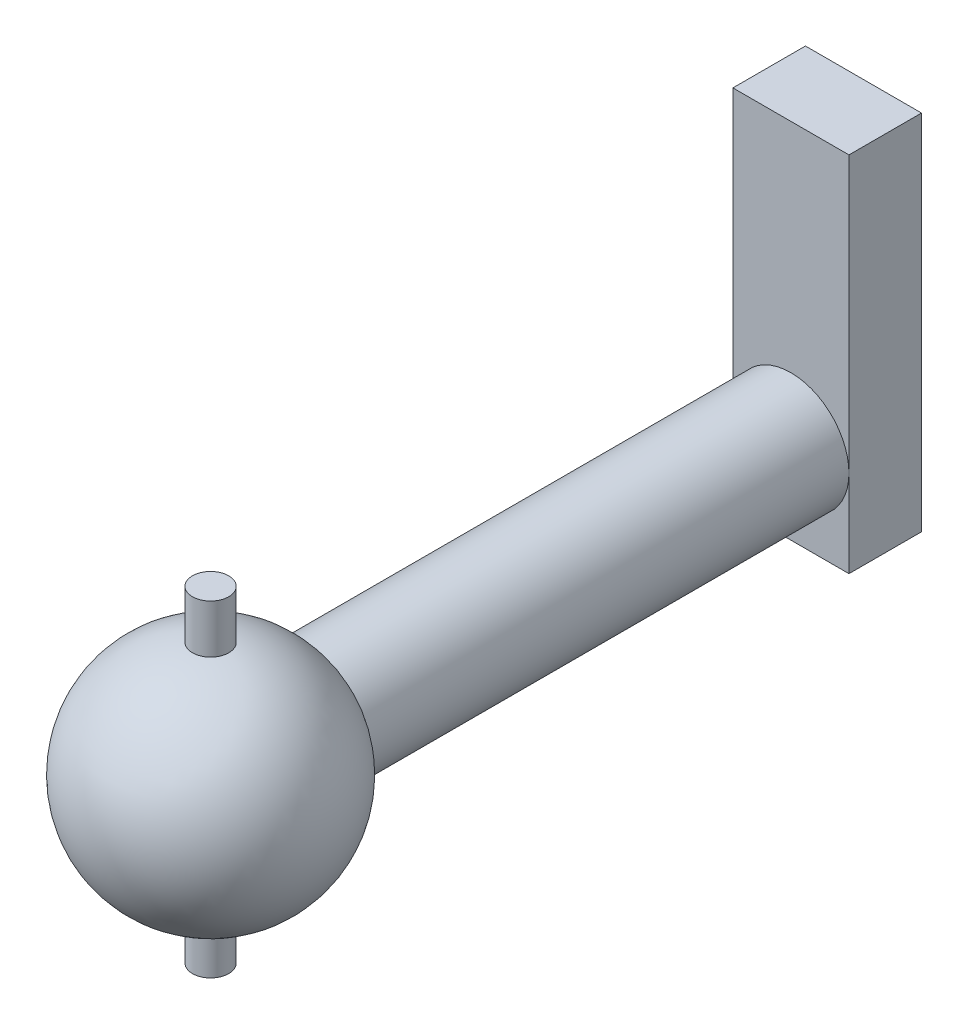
from build123d import *

# Parameters (mm, degrees)
ESQUISSE1_R        = 8
BOSS_EXTRU_1_DEPTH = 80
ESQUISSE2_W        = 16
ESQUISSE2_H        = 50
BOSS_EXTRU_2_DEPTH = 10
ESQUISSE5_R        = 2.5
BOSS_EXTRU_3_DEPTH = 22.5


with BuildPart() as part:
    # Esquisse1 → Boss.-Extru.1 (new body)
    with BuildSketch(Plane.XY):
        Circle(ESQUISSE1_R)
    extrude(amount=BOSS_EXTRU_1_DEPTH)

    # Esquisse2 → Boss.-Extru.2 (add)
    with BuildSketch(Plane(origin=(0, 0, 0), x_dir=(-1, 0, 0), z_dir=(0, 0, -1))):
        with Locations((0, 13)):
            Rectangle(ESQUISSE2_W, ESQUISSE2_H)
    extrude(amount=BOSS_EXTRU_2_DEPTH)

    # Esquisse4 → R_volution1 (revolve)
    with BuildSketch(Plane.XY.offset(80)):
        with BuildLine():
            Line((0, 16), (0, -16))
            ThreePointArc((0, -16), (16, 0), (0, 16))
        make_face()
    revolve(axis=Axis((0, 19.824994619, 80), (0, -1, 0)))

    # Esquisse5 → Boss.-Extru.3 (add, symmetric)
    with BuildSketch(Plane(origin=(0, 0, 0), x_dir=(1, 0, 0), z_dir=(0, 1, 0))):
        with Locations(Location((0, -80, 0), (0, 0, 90))):
            Circle(ESQUISSE5_R)
    extrude(amount=BOSS_EXTRU_3_DEPTH, both=True)


solid = part.part
